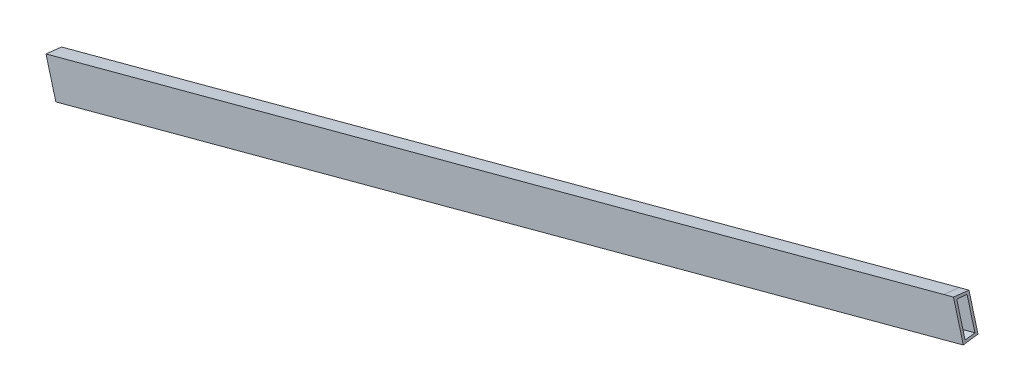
ISO-10303-21;
HEADER;
FILE_DESCRIPTION(('STEP AP214'),'2;1');
FILE_NAME('part.step','',(''),(''),'','','');
FILE_SCHEMA(('AUTOMOTIVE_DESIGN { 1 0 10303 214 1 1 1 1 }'));
ENDSEC;
DATA;
#1=APPLICATION_CONTEXT('core data for automotive mechanical design processes');
#2=APPLICATION_PROTOCOL_DEFINITION('international standard','automotive_design',2000,#1);
#3=PRODUCT_CONTEXT('',#1,'mechanical');
#4=PRODUCT('Part','Part','',(#3));
#5=PRODUCT_RELATED_PRODUCT_CATEGORY('part','',(#4));
#6=PRODUCT_DEFINITION_FORMATION('','',#4);
#7=PRODUCT_DEFINITION_CONTEXT('part definition',#1,'design');
#8=PRODUCT_DEFINITION('design','',#6,#7);
#9=PRODUCT_DEFINITION_SHAPE('','',#8);
#10=(LENGTH_UNIT() NAMED_UNIT(*) SI_UNIT(.MILLI.,.METRE.));
#11=(NAMED_UNIT(*) PLANE_ANGLE_UNIT() SI_UNIT($,.RADIAN.));
#12=(NAMED_UNIT(*) SI_UNIT($,.STERADIAN.) SOLID_ANGLE_UNIT());
#13=UNCERTAINTY_MEASURE_WITH_UNIT(LENGTH_MEASURE(1.E-05),#10,'distance_accuracy_value','');
#14=(GEOMETRIC_REPRESENTATION_CONTEXT(3) GLOBAL_UNCERTAINTY_ASSIGNED_CONTEXT((#13)) GLOBAL_UNIT_ASSIGNED_CONTEXT((#10,
#11,#12)) REPRESENTATION_CONTEXT('',''));
#15=CARTESIAN_POINT('',(0.,0.,0.));
#16=DIRECTION('',(0.,0.,1.));
#17=DIRECTION('',(1.,0.,0.));
#18=AXIS2_PLACEMENT_3D('',#15,#16,#17);
#19=CARTESIAN_POINT('',(25.4,17.9380619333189,-64.29375));
#20=CARTESIAN_POINT('',(310.61406,94.360938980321,-64.29375));
#21=CARTESIAN_POINT('',(25.4,17.839293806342,-65.3524623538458));
#22=CARTESIAN_POINT('',(310.61406,94.2621708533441,-65.3524623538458));
#23=CARTESIAN_POINT('',(25.4,17.7362869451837,-66.4107849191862));
#24=CARTESIAN_POINT('',(310.61406,94.1591639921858,-66.4107849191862));
#25=CARTESIAN_POINT('',(25.4,17.6298121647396,-67.46875));
#26=CARTESIAN_POINT('',(310.61406,94.0526892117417,-67.46875));
#27=B_SPLINE_SURFACE_WITH_KNOTS('',3,1,((#19,#20),(#21,#22),(#23,#24),(#25,#26)),.UNSPECIFIED.,
.F.,.F.,.F.,(4,4),(2,2),(0.,1.),(0.,1.),.UNSPECIFIED.);
#28=CARTESIAN_POINT('',(25.6948739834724,17.70882341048,-67.46875));
#29=CARTESIAN_POINT('',(25.6882169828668,17.7336676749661,-67.2041662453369));
#30=CARTESIAN_POINT('',(25.6816142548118,17.7583093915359,-66.939562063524));
#31=CARTESIAN_POINT('',(25.668523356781,17.8071652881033,-66.4103113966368));
#32=CARTESIAN_POINT('',(25.6620351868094,17.8313794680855,-66.1456649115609));
#33=CARTESIAN_POINT('',(25.6427598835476,17.9033158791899,-65.3520036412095));
#34=CARTESIAN_POINT('',(25.6301532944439,17.9503643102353,-64.8229233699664));
#35=CARTESIAN_POINT('',(25.6178115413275,17.9964243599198,-64.29375));
#36=B_SPLINE_CURVE_WITH_KNOTS('',3,(#28,#29,#30,#31,#32,#33,#34,#35),.UNSPECIFIED.,.F.,.F.,(4,2,
2,4),(0.,0.79749295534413,1.59498593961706,3.18893602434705),.UNSPECIFIED.);
#37=CARTESIAN_POINT('',(25.6948739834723,17.70882341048,-67.46875));
#38=VERTEX_POINT('',#37);
#39=CARTESIAN_POINT('',(25.6178115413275,17.9964243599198,-64.29375));
#40=VERTEX_POINT('',#39);
#41=EDGE_CURVE('E11',#38,#40,#36,.T.);
#42=DIRECTION('',(0.965925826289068,0.258819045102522,0.));
#43=VECTOR('',#42,1.);
#44=CARTESIAN_POINT('',(25.4,17.6298121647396,-67.46875));
#45=LINE('',#44,#43);
#46=CARTESIAN_POINT('',(307.825533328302,93.3055057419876,-67.46875));
#47=VERTEX_POINT('',#46);
#48=EDGE_CURVE('E248',#38,#47,#45,.T.);
#49=CARTESIAN_POINT('',(307.748470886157,93.5931066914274,-64.29375));
#50=CARTESIAN_POINT('',(307.754645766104,93.570061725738,-64.5585083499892));
#51=CARTESIAN_POINT('',(307.760886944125,93.546769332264,-64.8232435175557));
#52=CARTESIAN_POINT('',(307.773495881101,93.4997121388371,-65.3526688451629));
#53=CARTESIAN_POINT('',(307.779863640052,93.4759473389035,-65.6173590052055));
#54=CARTESIAN_POINT('',(307.799139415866,93.4040091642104,-66.411020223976));
#55=CARTESIAN_POINT('',(307.812227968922,93.3551620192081,-66.9399259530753));
#56=CARTESIAN_POINT('',(307.825533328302,93.3055057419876,-67.46875));
#57=B_SPLINE_CURVE_WITH_KNOTS('',3,(#49,#50,#51,#52,#53,#54,#55,#56),.UNSPECIFIED.,.F.,.F.,(4,2,
2,4),(0.,0.79749305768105,1.59498608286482,3.18893614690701),.UNSPECIFIED.);
#58=CARTESIAN_POINT('',(307.748470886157,93.5931066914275,-64.29375));
#59=VERTEX_POINT('',#58);
#60=EDGE_CURVE('E48',#59,#47,#57,.T.);
#61=DIRECTION('',(0.965925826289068,0.258819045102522,0.));
#62=VECTOR('',#61,1.);
#63=CARTESIAN_POINT('',(25.4,17.9380619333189,-64.29375));
#64=LINE('',#63,#62);
#65=EDGE_CURVE('E217',#40,#59,#64,.T.);
#66=ORIENTED_EDGE('',*,*,#41,.F.);
#67=ORIENTED_EDGE('',*,*,#48,.T.);
#68=ORIENTED_EDGE('',*,*,#60,.F.);
#69=ORIENTED_EDGE('',*,*,#65,.F.);
#70=EDGE_LOOP('',(#66,#67,#68,#69));
#71=FACE_BOUND('',#70,.T.);
#72=ADVANCED_FACE('F37',(#71),#27,.T.);
#73=CARTESIAN_POINT('',(25.4,17.9380619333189,-64.29375));
#74=DIRECTION('',(0.,0.,-1.));
#75=DIRECTION('',(0.,1.,0.));
#76=AXIS2_PLACEMENT_3D('',#73,#74,#75);
#77=PLANE('',#76);
#78=DIRECTION('',(0.258819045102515,-0.96592582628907,0.));
#79=VECTOR('',#78,1.);
#80=CARTESIAN_POINT('',(25.6178115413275,17.9964243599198,-64.29375));
#81=LINE('',#80,#79);
#82=CARTESIAN_POINT('',(28.2589602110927,8.13952333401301,-64.29375));
#83=VERTEX_POINT('',#82);
#84=EDGE_CURVE('E218',#40,#83,#81,.T.);
#85=ORIENTED_EDGE('',*,*,#84,.F.);
#86=ORIENTED_EDGE('',*,*,#65,.T.);
#87=DIRECTION('',(-0.965925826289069,-0.258819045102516,0.));
#88=VECTOR('',#87,1.);
#89=CARTESIAN_POINT('',(310.815285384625,94.414857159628,-64.29375));
#90=LINE('',#89,#88);
#91=CARTESIAN_POINT('',(310.815285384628,94.4148571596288,-64.29375));
#92=VERTEX_POINT('',#91);
#93=EDGE_CURVE('E174',#92,#59,#90,.T.);
#94=ORIENTED_EDGE('',*,*,#93,.F.);
#95=DIRECTION('',(0.258819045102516,-0.96592582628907,0.));
#96=VECTOR('',#95,1.);
#97=CARTESIAN_POINT('',(313.45643405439,84.5579561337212,-64.29375));
#98=LINE('',#97,#96);
#99=CARTESIAN_POINT('',(313.45643405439,84.5579561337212,-64.29375));
#100=VERTEX_POINT('',#99);
#101=EDGE_CURVE('E164',#92,#100,#98,.T.);
#102=ORIENTED_EDGE('',*,*,#101,.T.);
#103=DIRECTION('',(-0.965925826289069,-0.258819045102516,0.));
#104=VECTOR('',#103,1.);
#105=CARTESIAN_POINT('',(313.45643405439,84.5579561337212,-64.29375));
#106=LINE('',#105,#104);
#107=CARTESIAN_POINT('',(310.389619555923,83.7362056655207,-64.29375));
#108=VERTEX_POINT('',#107);
#109=EDGE_CURVE('E139',#100,#108,#106,.T.);
#110=ORIENTED_EDGE('',*,*,#109,.T.);
#111=DIRECTION('',(0.965925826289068,0.258819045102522,0.));
#112=VECTOR('',#111,1.);
#113=CARTESIAN_POINT('',(25.4,7.37346725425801,-64.29375));
#114=LINE('',#113,#112);
#115=EDGE_CURVE('E221',#83,#108,#114,.T.);
#116=ORIENTED_EDGE('',*,*,#115,.F.);
#117=EDGE_LOOP('',(#85,#86,#94,#102,#110,#116));
#118=FACE_BOUND('',#117,.T.);
#119=ADVANCED_FACE('F213',(#118),#77,.T.);
#120=CARTESIAN_POINT('',(25.4,7.75018981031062,-67.46875));
#121=CARTESIAN_POINT('',(310.61406,84.1730668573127,-67.46875));
#122=CARTESIAN_POINT('',(25.4,7.62969544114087,-66.4098262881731));
#123=CARTESIAN_POINT('',(310.61406,84.0525724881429,-66.4098262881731));
#124=CARTESIAN_POINT('',(25.4,7.50404126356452,-65.3514781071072));
#125=CARTESIAN_POINT('',(310.61406,83.9269183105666,-65.3514781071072));
#126=CARTESIAN_POINT('',(25.4,7.37346725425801,-64.29375));
#127=CARTESIAN_POINT('',(310.61406,83.7963443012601,-64.29375));
#128=B_SPLINE_SURFACE_WITH_KNOTS('',3,1,((#120,#121),(#122,#123),(#124,#125),(#126,#127)),
.UNSPECIFIED.,.F.,.F.,.F.,(4,4),(2,2),(0.,1.),(0.,1.),.UNSPECIFIED.);
#129=CARTESIAN_POINT('',(28.2589602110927,8.13952333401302,-64.29375));
#130=CARTESIAN_POINT('',(28.2507950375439,8.16999617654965,-64.558321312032));
#131=CARTESIAN_POINT('',(28.242706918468,8.20018144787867,-64.8229281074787));
#132=CARTESIAN_POINT('',(28.2266866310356,8.25996997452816,-65.352212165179));
#133=CARTESIAN_POINT('',(28.2187544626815,8.28957322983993,-65.6168894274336));
#134=CARTESIAN_POINT('',(28.1952098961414,8.37744274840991,-66.4105121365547));
#135=CARTESIAN_POINT('',(28.1798335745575,8.43482796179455,-66.9395622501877));
#136=CARTESIAN_POINT('',(28.1647795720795,8.4910102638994,-67.46875));
#137=B_SPLINE_CURVE_WITH_KNOTS('',3,(#129,#130,#131,#132,#133,#134,#135,#136),.UNSPECIFIED.,.F.,
.F.,(4,2,2,4),(0.,0.799336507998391,1.59867302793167,3.19579392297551),.UNSPECIFIED.);
#138=CARTESIAN_POINT('',(28.1647795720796,8.4910102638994,-67.46875));
#139=VERTEX_POINT('',#138);
#140=EDGE_CURVE('E501',#83,#139,#137,.T.);
#141=CARTESIAN_POINT('',(310.295438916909,84.087692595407,-67.46875));
#142=CARTESIAN_POINT('',(310.302973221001,84.059574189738,-67.2038993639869));
#143=CARTESIAN_POINT('',(310.310588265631,84.0311544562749,-66.9390830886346));
#144=CARTESIAN_POINT('',(310.325977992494,83.9737192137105,-66.4095197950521));
#145=CARTESIAN_POINT('',(310.333752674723,83.9447037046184,-66.1447727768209));
#146=CARTESIAN_POINT('',(310.357298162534,83.8568307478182,-65.3511504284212));
#147=CARTESIAN_POINT('',(310.373305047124,83.797092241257,-64.8223795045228));
#148=CARTESIAN_POINT('',(310.389619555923,83.7362056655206,-64.29375));
#149=B_SPLINE_CURVE_WITH_KNOTS('',3,(#141,#142,#143,#144,#145,#146,#147,#148),.UNSPECIFIED.,.F.,
.F.,(4,2,2,4),(0.,0.799336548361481,1.5986730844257,3.19579397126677),.UNSPECIFIED.);
#150=CARTESIAN_POINT('',(310.29543891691,84.087692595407,-67.46875));
#151=VERTEX_POINT('',#150);
#152=EDGE_CURVE('E366',#151,#108,#149,.T.);
#153=DIRECTION('',(0.965925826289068,0.258819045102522,0.));
#154=VECTOR('',#153,1.);
#155=CARTESIAN_POINT('',(25.4,7.75018981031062,-67.46875));
#156=LINE('',#155,#154);
#157=EDGE_CURVE('E153',#139,#151,#156,.T.);
#158=ORIENTED_EDGE('',*,*,#140,.F.);
#159=ORIENTED_EDGE('',*,*,#115,.T.);
#160=ORIENTED_EDGE('',*,*,#152,.F.);
#161=ORIENTED_EDGE('',*,*,#157,.F.);
#162=EDGE_LOOP('',(#158,#159,#160,#161));
#163=FACE_BOUND('',#162,.T.);
#164=ADVANCED_FACE('F504',(#163),#128,.T.);
#165=CARTESIAN_POINT('',(25.4,7.75018981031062,-67.46875));
#166=DIRECTION('',(0.,0.,1.));
#167=DIRECTION('',(0.,-1.,0.));
#168=AXIS2_PLACEMENT_3D('',#165,#166,#167);
#169=PLANE('',#168);
#170=DIRECTION('',(-0.258819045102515,0.96592582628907,0.));
#171=VECTOR('',#170,1.);
#172=CARTESIAN_POINT('',(28.1647795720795,8.49101026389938,-67.46875));
#173=LINE('',#172,#171);
#174=EDGE_CURVE('E301',#139,#38,#173,.T.);
#175=ORIENTED_EDGE('',*,*,#174,.F.);
#176=ORIENTED_EDGE('',*,*,#157,.T.);
#177=DIRECTION('',(-0.965925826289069,-0.258819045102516,0.));
#178=VECTOR('',#177,1.);
#179=CARTESIAN_POINT('',(313.362253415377,84.9094430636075,-67.46875));
#180=LINE('',#179,#178);
#181=CARTESIAN_POINT('',(313.362253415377,84.9094430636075,-67.46875));
#182=VERTEX_POINT('',#181);
#183=EDGE_CURVE('E137',#182,#151,#180,.T.);
#184=ORIENTED_EDGE('',*,*,#183,.F.);
#185=DIRECTION('',(-0.258819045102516,0.965925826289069,0.));
#186=VECTOR('',#185,1.);
#187=CARTESIAN_POINT('',(310.89234782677,94.1272562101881,-67.46875));
#188=LINE('',#187,#186);
#189=CARTESIAN_POINT('',(310.89234782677,94.1272562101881,-67.46875));
#190=VERTEX_POINT('',#189);
#191=EDGE_CURVE('E144',#182,#190,#188,.T.);
#192=ORIENTED_EDGE('',*,*,#191,.T.);
#193=DIRECTION('',(-0.965925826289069,-0.258819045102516,0.));
#194=VECTOR('',#193,1.);
#195=CARTESIAN_POINT('',(310.89234782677,94.1272562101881,-67.46875));
#196=LINE('',#195,#194);
#197=EDGE_CURVE('E156',#190,#47,#196,.T.);
#198=ORIENTED_EDGE('',*,*,#197,.T.);
#199=ORIENTED_EDGE('',*,*,#48,.F.);
#200=EDGE_LOOP('',(#175,#176,#184,#192,#198,#199));
#201=FACE_BOUND('',#200,.T.);
#202=ADVANCED_FACE('F149',(#201),#169,.T.);
#203=CARTESIAN_POINT('',(25.4,18.809308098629,-68.2625));
#204=DIRECTION('',(0.96592582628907,0.258819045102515,0.));
#205=DIRECTION('',(-0.258819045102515,0.96592582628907,0.));
#206=AXIS2_PLACEMENT_3D('',#203,#204,#205);
#207=PLANE('',#206);
#208=CARTESIAN_POINT('',(25.4,18.809308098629,-63.5));
#209=CARTESIAN_POINT('',(25.4092621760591,18.7747411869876,-63.8971313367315));
#210=CARTESIAN_POINT('',(25.4186121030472,18.7398467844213,-64.2942321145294));
#211=CARTESIAN_POINT('',(25.4374901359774,18.6693930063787,-65.0883704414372));
#212=CARTESIAN_POINT('',(25.4470182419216,18.633833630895,-65.4854079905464));
#213=CARTESIAN_POINT('',(25.4758613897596,18.5261895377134,-66.6759085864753));
#214=CARTESIAN_POINT('',(25.4954472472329,18.4530941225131,-67.4692737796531));
#215=CARTESIAN_POINT('',(25.5154050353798,18.3786106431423,-68.2625));
#216=B_SPLINE_CURVE_WITH_KNOTS('',3,(#208,#209,#210,#211,#212,#213,#214,#215),.UNSPECIFIED.,.F.,
.F.,(4,2,2,4),(0.,1.1962212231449,2.39244245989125,4.78333610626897),.UNSPECIFIED.);
#217=CARTESIAN_POINT('',(25.4,18.809308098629,-63.499994));
#218=VERTEX_POINT('',#217);
#219=CARTESIAN_POINT('',(25.5154050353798,18.3786106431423,-68.2625));
#220=VERTEX_POINT('',#219);
#221=EDGE_CURVE('E56',#218,#220,#216,.T.);
#222=ORIENTED_EDGE('',*,*,#221,.T.);
#223=DIRECTION('',(-0.258819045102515,0.96592582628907,0.));
#224=VECTOR('',#223,1.);
#225=CARTESIAN_POINT('',(25.4,18.809308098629,-68.2625));
#226=LINE('',#225,#224);
#227=CARTESIAN_POINT('',(28.3419175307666,7.82992240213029,-68.2625));
#228=VERTEX_POINT('',#227);
#229=EDGE_CURVE('E367',#228,#220,#226,.T.);
#230=ORIENTED_EDGE('',*,*,#229,.F.);
#231=CARTESIAN_POINT('',(28.3419175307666,7.82992240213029,-68.2625));
#232=CARTESIAN_POINT('',(28.3532192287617,7.78774389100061,-67.8652155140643));
#233=CARTESIAN_POINT('',(28.3646551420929,7.7450644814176,-67.4679883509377));
#234=CARTESIAN_POINT('',(28.3877795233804,7.65876311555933,-66.6736437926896));
#235=CARTESIAN_POINT('',(28.3994679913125,7.61514115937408,-66.2765263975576));
#236=CARTESIAN_POINT('',(28.4348654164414,7.48303617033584,-65.086104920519));
#237=CARTESIAN_POINT('',(28.4589284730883,7.393231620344,-64.292957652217));
#238=CARTESIAN_POINT('',(28.48340065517,7.30190019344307,-63.5));
#239=B_SPLINE_CURVE_WITH_KNOTS('',3,(#231,#232,#233,#234,#235,#236,#237,#238),.UNSPECIFIED.,.F.,
.F.,(4,2,2,4),(0.,1.19903015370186,2.39806019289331,4.7937845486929),.UNSPECIFIED.);
#240=CARTESIAN_POINT('',(28.48340065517,7.30190019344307,-63.5));
#241=VERTEX_POINT('',#240);
#242=EDGE_CURVE('E293',#228,#241,#239,.T.);
#243=ORIENTED_EDGE('',*,*,#242,.T.);
#244=DIRECTION('',(-0.258819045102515,0.96592582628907,0.));
#245=VECTOR('',#244,1.);
#246=CARTESIAN_POINT('',(25.4,18.809308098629,-63.5));
#247=LINE('',#246,#245);
#248=EDGE_CURVE('E300',#241,#218,#247,.T.);
#249=ORIENTED_EDGE('',*,*,#248,.T.);
#250=EDGE_LOOP('',(#222,#230,#243,#249));
#251=FACE_BOUND('',#250,.T.);
#252=ORIENTED_EDGE('',*,*,#174,.T.);
#253=ORIENTED_EDGE('',*,*,#41,.T.);
#254=ORIENTED_EDGE('',*,*,#84,.T.);
#255=ORIENTED_EDGE('',*,*,#140,.T.);
#256=EDGE_LOOP('',(#252,#253,#254,#255));
#257=FACE_BOUND('',#256,.T.);
#258=ADVANCED_FACE('F258',(#251,#257),#207,.F.);
#259=CARTESIAN_POINT('',(25.4,18.3476879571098,-68.2625));
#260=CARTESIAN_POINT('',(310.61406,94.7705650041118,-68.2625));
#261=CARTESIAN_POINT('',(25.4,18.5073976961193,-66.6755765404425));
#262=CARTESIAN_POINT('',(310.61406,94.9302747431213,-66.6755765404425));
#263=CARTESIAN_POINT('',(25.4,18.6611581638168,-65.0880443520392));
#264=CARTESIAN_POINT('',(310.61406,95.0840352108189,-65.0880443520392));
#265=CARTESIAN_POINT('',(25.4,18.809308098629,-63.5));
#266=CARTESIAN_POINT('',(310.61406,95.2321851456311,-63.5));
#267=B_SPLINE_SURFACE_WITH_KNOTS('',3,1,((#259,#260),(#261,#262),(#263,#264),(#265,#266)),
.UNSPECIFIED.,.F.,.F.,.F.,(4,4),(2,2),(0.,1.),(0.,1.),.UNSPECIFIED.);
#268=DIRECTION('',(0.965925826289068,0.258819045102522,0.));
#269=VECTOR('',#268,1.);
#270=CARTESIAN_POINT('',(25.4,18.809308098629,-63.5));
#271=LINE('',#270,#269);
#272=CARTESIAN_POINT('',(307.53065934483,94.4059904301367,-63.5));
#273=VERTEX_POINT('',#272);
#274=EDGE_CURVE('E473',#218,#273,#271,.T.);
#275=CARTESIAN_POINT('',(307.64606438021,93.9752929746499,-68.2625));
#276=CARTESIAN_POINT('',(307.636079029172,94.0125588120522,-67.8656303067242));
#277=CARTESIAN_POINT('',(307.626186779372,94.0494771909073,-67.4687257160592));
#278=CARTESIAN_POINT('',(307.606585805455,94.1226290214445,-66.674848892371));
#279=CARTESIAN_POINT('',(307.596877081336,94.1588624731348,-66.2778766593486));
#280=CARTESIAN_POINT('',(307.568034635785,94.2665039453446,-65.0873757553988));
#281=CARTESIAN_POINT('',(307.549171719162,94.3369013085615,-64.2937490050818));
#282=CARTESIAN_POINT('',(307.53065934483,94.4059904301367,-63.5000000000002));
#283=B_SPLINE_CURVE_WITH_KNOTS('',3,(#275,#276,#277,#278,#279,#280,#281,#282),.UNSPECIFIED.,.F.,
.F.,(4,2,2,4),(0.,1.19622126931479,2.39244252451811,4.78333616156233),.UNSPECIFIED.);
#284=CARTESIAN_POINT('',(307.64606438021,93.9752929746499,-68.2625));
#285=VERTEX_POINT('',#284);
#286=EDGE_CURVE('E344',#285,#273,#283,.T.);
#287=DIRECTION('',(0.965925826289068,0.258819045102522,0.));
#288=VECTOR('',#287,1.);
#289=CARTESIAN_POINT('',(25.4,18.3476879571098,-68.2625));
#290=LINE('',#289,#288);
#291=EDGE_CURVE('E306',#220,#285,#290,.T.);
#292=ORIENTED_EDGE('',*,*,#221,.F.);
#293=ORIENTED_EDGE('',*,*,#274,.T.);
#294=ORIENTED_EDGE('',*,*,#286,.F.);
#295=ORIENTED_EDGE('',*,*,#291,.F.);
#296=EDGE_LOOP('',(#292,#293,#294,#295));
#297=FACE_BOUND('',#296,.T.);
#298=ADVANCED_FACE('F317',(#297),#267,.T.);
#299=CARTESIAN_POINT('',(25.4,18.809308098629,-63.5));
#300=DIRECTION('',(0.,0.,1.));
#301=DIRECTION('',(0.,-1.,0.));
#302=AXIS2_PLACEMENT_3D('',#299,#300,#301);
#303=PLANE('',#302);
#304=ORIENTED_EDGE('',*,*,#248,.F.);
#305=DIRECTION('',(0.965925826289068,0.258819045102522,0.));
#306=VECTOR('',#305,1.);
#307=CARTESIAN_POINT('',(25.4,6.47570547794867,-63.5));
#308=LINE('',#307,#306);
#309=CARTESIAN_POINT('',(310.61406,82.8985825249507,-63.5));
#310=VERTEX_POINT('',#309);
#311=EDGE_CURVE('E488',#241,#310,#308,.T.);
#312=ORIENTED_EDGE('',*,*,#311,.T.);
#313=DIRECTION('',(-0.965925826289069,-0.258819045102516,0.));
#314=VECTOR('',#313,1.);
#315=CARTESIAN_POINT('',(313.680874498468,83.7203329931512,-63.5));
#316=LINE('',#315,#314);
#317=CARTESIAN_POINT('',(313.680874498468,83.7203329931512,-63.5));
#318=VERTEX_POINT('',#317);
#319=EDGE_CURVE('E372',#318,#310,#316,.T.);
#320=ORIENTED_EDGE('',*,*,#319,.F.);
#321=DIRECTION('',(0.258819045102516,-0.96592582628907,0.));
#322=VECTOR('',#321,1.);
#323=CARTESIAN_POINT('',(310.597473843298,95.2277408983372,-63.5));
#324=LINE('',#323,#322);
#325=CARTESIAN_POINT('',(310.597473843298,95.2277408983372,-63.5));
#326=VERTEX_POINT('',#325);
#327=EDGE_CURVE('E447',#326,#318,#324,.T.);
#328=ORIENTED_EDGE('',*,*,#327,.F.);
#329=DIRECTION('',(-0.965925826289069,-0.258819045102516,0.));
#330=VECTOR('',#329,1.);
#331=CARTESIAN_POINT('',(310.597473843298,95.2277408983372,-63.5));
#332=LINE('',#331,#330);
#333=EDGE_CURVE('E369',#326,#273,#332,.T.);
#334=ORIENTED_EDGE('',*,*,#333,.T.);
#335=ORIENTED_EDGE('',*,*,#274,.F.);
#336=EDGE_LOOP('',(#304,#312,#320,#328,#334,#335));
#337=FACE_BOUND('',#336,.T.);
#338=ADVANCED_FACE('F282',(#337),#303,.T.);
#339=CARTESIAN_POINT('',(25.4,6.47570547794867,-63.5));
#340=CARTESIAN_POINT('',(310.61406,82.8985825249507,-63.5));
#341=CARTESIAN_POINT('',(25.4,6.67157057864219,-65.0866252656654));
#342=CARTESIAN_POINT('',(310.61406,83.0944476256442,-65.0866252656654));
#343=CARTESIAN_POINT('',(25.4,6.8608926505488,-66.6740812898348));
#344=CARTESIAN_POINT('',(310.61406,83.2837696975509,-66.6740812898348));
#345=CARTESIAN_POINT('',(25.4,7.04163797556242,-68.2625));
#346=CARTESIAN_POINT('',(310.61406,83.4645150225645,-68.2625));
#347=B_SPLINE_SURFACE_WITH_KNOTS('',3,1,((#339,#340),(#341,#342),(#343,#344),(#345,#346)),
.UNSPECIFIED.,.F.,.F.,.F.,(4,4),(2,2),(0.,1.),(0.,1.),.UNSPECIFIED.);
#348=DIRECTION('',(0.965925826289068,0.258819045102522,0.));
#349=VECTOR('',#348,1.);
#350=CARTESIAN_POINT('',(25.4,7.04163797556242,-68.2625));
#351=LINE('',#350,#349);
#352=CARTESIAN_POINT('',(310.472576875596,83.4266047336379,-68.2625));
#353=VERTEX_POINT('',#352);
#354=EDGE_CURVE('E490',#228,#353,#351,.T.);
#355=CARTESIAN_POINT('',(310.61406,82.8985825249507,-63.5));
#356=CARTESIAN_POINT('',(310.60181198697,82.9442927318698,-63.8968651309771));
#357=CARTESIAN_POINT('',(310.589666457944,82.9896204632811,-64.2937776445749));
#358=CARTESIAN_POINT('',(310.565596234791,83.0794517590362,-65.0877026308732));
#359=CARTESIAN_POINT('',(310.553671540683,83.1239553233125,-65.4847151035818));
#360=CARTESIAN_POINT('',(310.518275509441,83.2560551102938,-66.6751367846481));
#361=CARTESIAN_POINT('',(310.495158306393,83.3423296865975,-67.4687032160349));
#362=CARTESIAN_POINT('',(310.472576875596,83.4266047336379,-68.2625));
#363=B_SPLINE_CURVE_WITH_KNOTS('',3,(#355,#356,#357,#358,#359,#360,#361,#362),.UNSPECIFIED.,.F.,
.F.,(4,2,2,4),(0.,1.19902979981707,2.39805969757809,4.79378412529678),.UNSPECIFIED.);
#364=EDGE_CURVE('E273',#310,#353,#363,.T.);
#365=ORIENTED_EDGE('',*,*,#242,.F.);
#366=ORIENTED_EDGE('',*,*,#354,.T.);
#367=ORIENTED_EDGE('',*,*,#364,.F.);
#368=ORIENTED_EDGE('',*,*,#311,.F.);
#369=EDGE_LOOP('',(#365,#366,#367,#368));
#370=FACE_BOUND('',#369,.T.);
#371=ADVANCED_FACE('F276',(#370),#347,.T.);
#372=CARTESIAN_POINT('',(25.4,7.04163797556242,-68.2625));
#373=DIRECTION('',(0.,0.,-1.));
#374=DIRECTION('',(0.,1.,0.));
#375=AXIS2_PLACEMENT_3D('',#372,#373,#374);
#376=PLANE('',#375);
#377=ORIENTED_EDGE('',*,*,#229,.T.);
#378=ORIENTED_EDGE('',*,*,#291,.T.);
#379=DIRECTION('',(-0.965925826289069,-0.258819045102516,0.));
#380=VECTOR('',#379,1.);
#381=CARTESIAN_POINT('',(310.712878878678,94.7970434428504,-68.2625));
#382=LINE('',#381,#380);
#383=CARTESIAN_POINT('',(310.712878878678,94.7970434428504,-68.2625));
#384=VERTEX_POINT('',#383);
#385=EDGE_CURVE('E451',#384,#285,#382,.T.);
#386=ORIENTED_EDGE('',*,*,#385,.F.);
#387=DIRECTION('',(-0.258819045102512,0.965925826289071,0.));
#388=VECTOR('',#387,1.);
#389=CARTESIAN_POINT('',(310.712878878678,94.7970434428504,-68.2625));
#390=LINE('',#389,#388);
#391=CARTESIAN_POINT('',(313.539391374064,84.2483552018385,-68.2625));
#392=VERTEX_POINT('',#391);
#393=EDGE_CURVE('E445',#392,#384,#390,.T.);
#394=ORIENTED_EDGE('',*,*,#393,.F.);
#395=DIRECTION('',(-0.965925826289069,-0.258819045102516,0.));
#396=VECTOR('',#395,1.);
#397=CARTESIAN_POINT('',(313.539391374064,84.2483552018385,-68.2625));
#398=LINE('',#397,#396);
#399=EDGE_CURVE('E64',#392,#353,#398,.T.);
#400=ORIENTED_EDGE('',*,*,#399,.T.);
#401=ORIENTED_EDGE('',*,*,#354,.F.);
#402=EDGE_LOOP('',(#377,#378,#386,#394,#400,#401));
#403=FACE_BOUND('',#402,.T.);
#404=ADVANCED_FACE('F39',(#403),#376,.T.);
#405=CARTESIAN_POINT('',(310.654091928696,95.0164393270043,-65.8816414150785));
#406=DIRECTION('',(-0.96592582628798,-0.258819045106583,3.95499587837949E-13));
#407=DIRECTION('',(0.258819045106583,-0.96592582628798,0.));
#408=AXIS2_PLACEMENT_3D('',#405,#406,#407);
#409=PLANE('',#408);
#410=CARTESIAN_POINT('',(310.597473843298,95.2277408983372,-63.5000000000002));
#411=CARTESIAN_POINT('',(310.615986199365,95.1586518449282,-64.2937483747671));
#412=CARTESIAN_POINT('',(310.634849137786,95.0882544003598,-65.0873759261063));
#413=CARTESIAN_POINT('',(310.654073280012,95.0165089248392,-65.8808716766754));
#414=CARTESIAN_POINT('',(310.663691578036,94.9806129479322,-66.2778765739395));
#415=CARTESIAN_POINT('',(310.673400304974,94.9443794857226,-66.6748489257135));
#416=CARTESIAN_POINT('',(310.683200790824,94.9078035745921,-67.0717873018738));
#417=CARTESIAN_POINT('',(310.693001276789,94.8712276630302,-67.4687256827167));
#418=CARTESIAN_POINT('',(310.702893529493,94.8343092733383,-67.8656304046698));
#419=CARTESIAN_POINT('',(310.712878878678,94.7970434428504,-68.2625));
#420=B_SPLINE_CURVE_WITH_KNOTS('',3,(#410,#411,#412,#413,#414,#415,#416,#417,#418,#419),
.UNSPECIFIED.,.F.,.F.,(4,3,3,4),(0.,0.00239089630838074,0.00358711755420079,
0.00478333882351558),.UNSPECIFIED.);
#421=EDGE_CURVE('E155',#384,#326,#420,.F.);
#422=ORIENTED_EDGE('',*,*,#421,.T.);
#423=ORIENTED_EDGE('',*,*,#327,.T.);
#424=CARTESIAN_POINT('',(313.539391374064,84.2483552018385,-68.2625));
#425=CARTESIAN_POINT('',(313.561972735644,84.1640804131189,-67.4687055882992));
#426=CARTESIAN_POINT('',(313.585090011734,84.0778055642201,-66.6751366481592));
#427=CARTESIAN_POINT('',(313.608679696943,83.9897676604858,-65.8817801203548));
#428=CARTESIAN_POINT('',(313.620486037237,83.9457057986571,-65.4847151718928));
#429=CARTESIAN_POINT('',(313.632410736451,83.9012022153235,-65.0877025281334));
#430=CARTESIAN_POINT('',(313.644445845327,83.8562865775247,-64.6907401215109));
#431=CARTESIAN_POINT('',(313.656480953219,83.8113709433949,-64.2937777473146));
#432=CARTESIAN_POINT('',(313.668626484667,83.7660432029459,-63.8968651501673));
#433=CARTESIAN_POINT('',(313.680874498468,83.7203329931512,-63.5));
#434=B_SPLINE_CURVE_WITH_KNOTS('',3,(#424,#425,#426,#427,#428,#429,#430,#431,#432,#433),
.UNSPECIFIED.,.F.,.F.,(4,3,3,4),(0.,0.00239572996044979,0.00359475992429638,
0.00479378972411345),.UNSPECIFIED.);
#435=EDGE_CURVE('E443',#318,#392,#434,.F.);
#436=ORIENTED_EDGE('',*,*,#435,.T.);
#437=ORIENTED_EDGE('',*,*,#393,.T.);
#438=EDGE_LOOP('',(#422,#423,#436,#437));
#439=FACE_BOUND('',#438,.T.);
#440=CARTESIAN_POINT('',(313.45643405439,84.5579561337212,-64.29375));
#441=CARTESIAN_POINT('',(313.440119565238,84.6188426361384,-64.8223787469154));
#442=CARTESIAN_POINT('',(313.424112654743,84.6785812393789,-65.3511506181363));
#443=CARTESIAN_POINT('',(313.408420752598,84.7371442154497,-65.8800606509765));
#444=CARTESIAN_POINT('',(313.400567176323,84.7664541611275,-66.1447726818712));
#445=CARTESIAN_POINT('',(313.392792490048,84.7954696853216,-66.4095198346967));
#446=CARTESIAN_POINT('',(313.38509762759,84.8241873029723,-66.6743014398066));
#447=CARTESIAN_POINT('',(313.377402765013,84.8529049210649,-66.93908304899));
#448=CARTESIAN_POINT('',(313.369787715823,84.8813246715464,-67.2038994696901));
#449=CARTESIAN_POINT('',(313.362253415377,84.9094430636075,-67.46875));
#450=B_SPLINE_CURVE_WITH_KNOTS('',3,(#440,#441,#442,#443,#444,#445,#446,#447,#448,#449),
.UNSPECIFIED.,.F.,.F.,(4,3,3,4),(0.,0.00159712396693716,0.00239646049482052,0.003195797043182),.UNSPECIFIED.);
#451=EDGE_CURVE('E132',#100,#182,#450,.T.);
#452=ORIENTED_EDGE('',*,*,#451,.F.);
#453=ORIENTED_EDGE('',*,*,#101,.F.);
#454=CARTESIAN_POINT('',(310.89234782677,94.1272562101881,-67.46875));
#455=CARTESIAN_POINT('',(310.879042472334,94.176912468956,-66.9399261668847));
#456=CARTESIAN_POINT('',(310.865953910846,94.2257596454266,-66.4110200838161));
#457=CARTESIAN_POINT('',(310.853106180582,94.2737080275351,-65.8820273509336));
#458=CARTESIAN_POINT('',(310.846678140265,94.2976978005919,-65.617359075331));
#459=CARTESIAN_POINT('',(310.840310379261,94.3214626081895,-65.3526688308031));
#460=CARTESIAN_POINT('',(310.834005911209,94.3449912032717,-65.0879561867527));
#461=CARTESIAN_POINT('',(310.827701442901,94.3685197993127,-64.8232435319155));
#462=CARTESIAN_POINT('',(310.821460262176,94.3918122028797,-64.5585082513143));
#463=CARTESIAN_POINT('',(310.815285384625,94.4148571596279,-64.29375));
#464=B_SPLINE_CURVE_WITH_KNOTS('',3,(#454,#455,#456,#457,#458,#459,#460,#461,#462,#463),
.UNSPECIFIED.,.F.,.F.,(4,3,3,4),(0.,0.0015939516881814,0.00239144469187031,0.00318893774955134),.UNSPECIFIED.);
#465=EDGE_CURVE('E161',#190,#92,#464,.T.);
#466=ORIENTED_EDGE('',*,*,#465,.F.);
#467=ORIENTED_EDGE('',*,*,#191,.F.);
#468=EDGE_LOOP('',(#452,#453,#466,#467));
#469=FACE_BOUND('',#468,.T.);
#470=ADVANCED_FACE('F159',(#439,#469),#409,.F.);
#471=CARTESIAN_POINT('',(310.712878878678,94.7970434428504,-68.2625));
#472=CARTESIAN_POINT('',(310.702893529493,94.8343092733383,-67.8656304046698));
#473=CARTESIAN_POINT('',(310.693001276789,94.8712276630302,-67.4687256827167));
#474=CARTESIAN_POINT('',(310.683200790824,94.9078035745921,-67.0717873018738));
#475=CARTESIAN_POINT('',(310.673400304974,94.9443794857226,-66.6748489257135));
#476=CARTESIAN_POINT('',(310.663691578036,94.9806129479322,-66.2778765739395));
#477=CARTESIAN_POINT('',(310.654073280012,95.0165089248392,-65.8808716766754));
#478=CARTESIAN_POINT('',(310.634849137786,95.0882544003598,-65.0873759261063));
#479=CARTESIAN_POINT('',(310.615986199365,95.1586518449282,-64.2937483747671));
#480=CARTESIAN_POINT('',(310.597473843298,95.2277408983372,-63.5000000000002));
#481=B_SPLINE_CURVE_WITH_KNOTS('',3,(#471,#472,#473,#474,#475,#476,#477,#478,#479,#480),
.UNSPECIFIED.,.F.,.F.,(4,3,3,4),(0.,0.00119622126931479,0.00239244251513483,
0.00478333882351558),.UNSPECIFIED.);
#482=DIRECTION('',(-0.965925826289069,-0.258819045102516,0.));
#483=VECTOR('',#482,1.);
#484=SURFACE_OF_LINEAR_EXTRUSION('',#481,#483);
#485=ORIENTED_EDGE('',*,*,#286,.T.);
#486=ORIENTED_EDGE('',*,*,#333,.F.);
#487=ORIENTED_EDGE('',*,*,#421,.F.);
#488=ORIENTED_EDGE('',*,*,#385,.T.);
#489=EDGE_LOOP('',(#485,#486,#487,#488));
#490=FACE_BOUND('',#489,.T.);
#491=ADVANCED_FACE('F386',(#490),#484,.F.);
#492=CARTESIAN_POINT('',(313.680874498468,83.7203329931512,-63.5));
#493=CARTESIAN_POINT('',(313.668626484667,83.7660432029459,-63.8968651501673));
#494=CARTESIAN_POINT('',(313.656480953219,83.8113709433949,-64.2937777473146));
#495=CARTESIAN_POINT('',(313.644445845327,83.8562865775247,-64.6907401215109));
#496=CARTESIAN_POINT('',(313.632410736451,83.9012022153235,-65.0877025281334));
#497=CARTESIAN_POINT('',(313.620486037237,83.9457057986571,-65.4847151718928));
#498=CARTESIAN_POINT('',(313.608679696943,83.9897676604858,-65.8817801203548));
#499=CARTESIAN_POINT('',(313.585090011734,84.0778055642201,-66.6751366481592));
#500=CARTESIAN_POINT('',(313.561972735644,84.1640804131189,-67.4687055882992));
#501=CARTESIAN_POINT('',(313.539391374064,84.2483552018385,-68.2625));
#502=B_SPLINE_CURVE_WITH_KNOTS('',3,(#492,#493,#494,#495,#496,#497,#498,#499,#500,#501),
.UNSPECIFIED.,.F.,.F.,(4,3,3,4),(0.,0.00119902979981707,0.00239805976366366,
0.00479378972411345),.UNSPECIFIED.);
#503=DIRECTION('',(-0.965925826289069,-0.258819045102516,0.));
#504=VECTOR('',#503,1.);
#505=SURFACE_OF_LINEAR_EXTRUSION('',#502,#504);
#506=ORIENTED_EDGE('',*,*,#364,.T.);
#507=ORIENTED_EDGE('',*,*,#399,.F.);
#508=ORIENTED_EDGE('',*,*,#435,.F.);
#509=ORIENTED_EDGE('',*,*,#319,.T.);
#510=EDGE_LOOP('',(#506,#507,#508,#509));
#511=FACE_BOUND('',#510,.T.);
#512=ADVANCED_FACE('F388',(#511),#505,.F.);
#513=CARTESIAN_POINT('',(313.45643405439,84.5579561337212,-64.29375));
#514=CARTESIAN_POINT('',(313.440119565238,84.6188426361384,-64.8223787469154));
#515=CARTESIAN_POINT('',(313.424112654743,84.6785812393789,-65.3511506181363));
#516=CARTESIAN_POINT('',(313.408420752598,84.7371442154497,-65.8800606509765));
#517=CARTESIAN_POINT('',(313.400567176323,84.7664541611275,-66.1447726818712));
#518=CARTESIAN_POINT('',(313.392792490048,84.7954696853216,-66.4095198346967));
#519=CARTESIAN_POINT('',(313.38509762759,84.8241873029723,-66.6743014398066));
#520=CARTESIAN_POINT('',(313.377402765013,84.8529049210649,-66.93908304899));
#521=CARTESIAN_POINT('',(313.369787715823,84.8813246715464,-67.2038994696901));
#522=CARTESIAN_POINT('',(313.362253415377,84.9094430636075,-67.46875));
#523=B_SPLINE_CURVE_WITH_KNOTS('',3,(#513,#514,#515,#516,#517,#518,#519,#520,#521,#522),
.UNSPECIFIED.,.F.,.F.,(4,3,3,4),(0.,0.00159712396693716,0.00239646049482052,0.003195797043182),.UNSPECIFIED.);
#524=DIRECTION('',(-0.965925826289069,-0.258819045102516,0.));
#525=VECTOR('',#524,1.);
#526=SURFACE_OF_LINEAR_EXTRUSION('',#523,#525);
#527=ORIENTED_EDGE('',*,*,#152,.T.);
#528=ORIENTED_EDGE('',*,*,#109,.F.);
#529=ORIENTED_EDGE('',*,*,#451,.T.);
#530=ORIENTED_EDGE('',*,*,#183,.T.);
#531=EDGE_LOOP('',(#527,#528,#529,#530));
#532=FACE_BOUND('',#531,.T.);
#533=ADVANCED_FACE('F136',(#532),#526,.T.);
#534=CARTESIAN_POINT('',(310.89234782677,94.1272562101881,-67.46875));
#535=CARTESIAN_POINT('',(310.879042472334,94.176912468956,-66.9399261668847));
#536=CARTESIAN_POINT('',(310.865953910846,94.2257596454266,-66.4110200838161));
#537=CARTESIAN_POINT('',(310.853106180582,94.2737080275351,-65.8820273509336));
#538=CARTESIAN_POINT('',(310.846678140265,94.2976978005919,-65.617359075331));
#539=CARTESIAN_POINT('',(310.840310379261,94.3214626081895,-65.3526688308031));
#540=CARTESIAN_POINT('',(310.834005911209,94.3449912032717,-65.0879561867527));
#541=CARTESIAN_POINT('',(310.827701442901,94.3685197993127,-64.8232435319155));
#542=CARTESIAN_POINT('',(310.821460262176,94.3918122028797,-64.5585082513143));
#543=CARTESIAN_POINT('',(310.815285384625,94.4148571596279,-64.29375));
#544=B_SPLINE_CURVE_WITH_KNOTS('',3,(#534,#535,#536,#537,#538,#539,#540,#541,#542,#543),
.UNSPECIFIED.,.F.,.F.,(4,3,3,4),(0.,0.0015939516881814,0.00239144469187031,0.00318893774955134),.UNSPECIFIED.);
#545=DIRECTION('',(-0.965925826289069,-0.258819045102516,0.));
#546=VECTOR('',#545,1.);
#547=SURFACE_OF_LINEAR_EXTRUSION('',#544,#546);
#548=ORIENTED_EDGE('',*,*,#60,.T.);
#549=ORIENTED_EDGE('',*,*,#197,.F.);
#550=ORIENTED_EDGE('',*,*,#465,.T.);
#551=ORIENTED_EDGE('',*,*,#93,.T.);
#552=EDGE_LOOP('',(#548,#549,#550,#551));
#553=FACE_BOUND('',#552,.T.);
#554=ADVANCED_FACE('F188',(#553),#547,.T.);
#555=CLOSED_SHELL('',(#72,#119,#164,#202,#258,#298,#338,#371,#404,#470,#491,#512,#533,#554));
#556=MANIFOLD_SOLID_BREP('B2',#555);
#557=ADVANCED_BREP_SHAPE_REPRESENTATION('',(#18,#556),#14);
#558=SHAPE_DEFINITION_REPRESENTATION(#9,#557);
ENDSEC;
END-ISO-10303-21;
